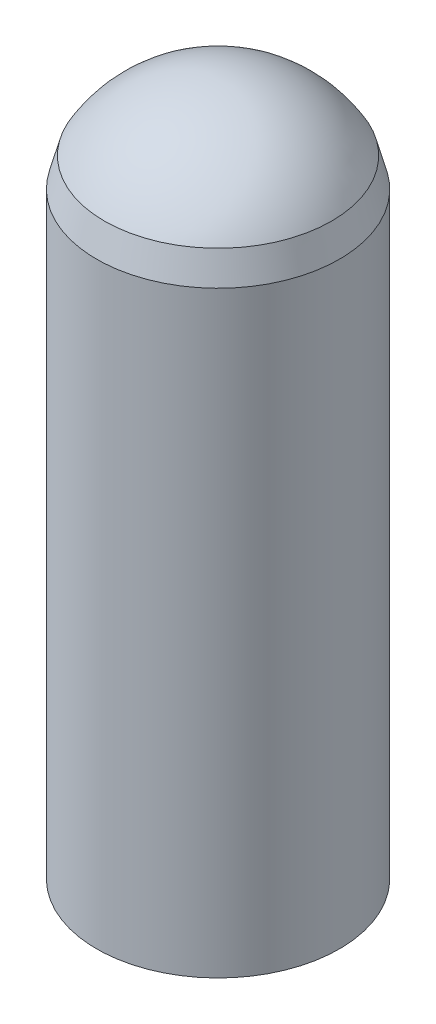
from build123d import *


with BuildPart() as part:
    # Skizze1 → Rotation1 (revolve)
    with BuildSketch(Plane.XY, mode=Mode.PRIVATE) as rotation1_sk:
        with BuildLine():
            Line((0, 6), (0, 0))
            Line((0, 0), (0.1, 0))
            ThreePointArc((0.1, 0), (0.574341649, 0.076975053), (1, 0.3))
            Line((1, 0.3), (1, 5.22))
            Line((1, 5.22), (0.935692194, 5.46))
            ThreePointArc((0.935692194, 5.46), (0.540166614, 5.855314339), (0, 6))
        make_face()
    revolve(rotation1_sk.sketch.rotate(Axis((0, 0, 0), (0, 1, 0)), 90), axis=Axis((0, 0, 0), (0, 1, 0)))


solid = part.part
